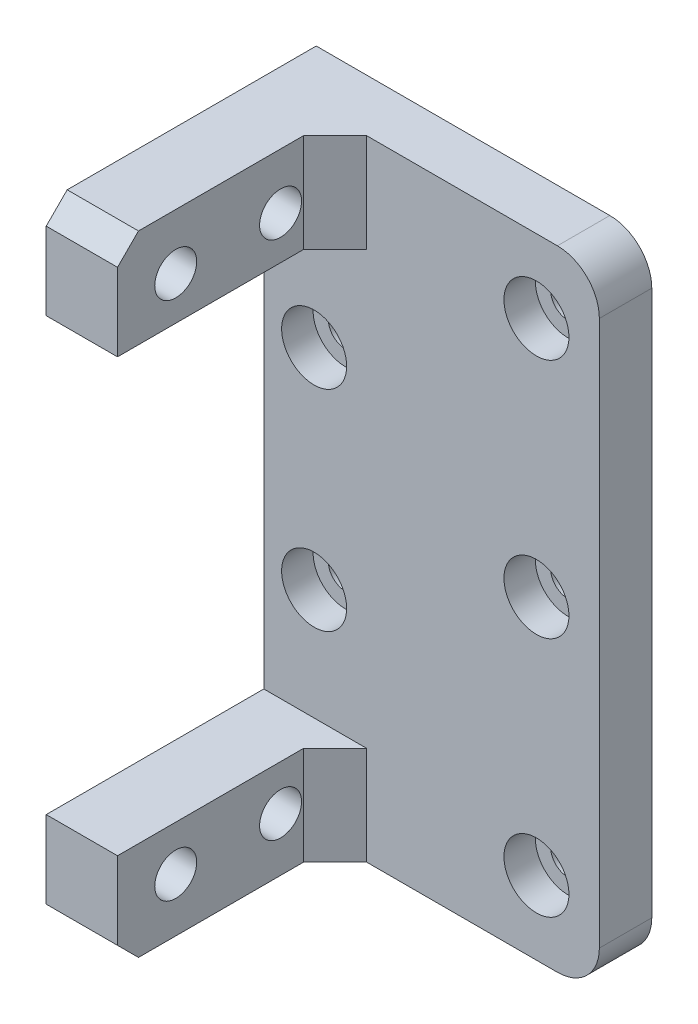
from build123d import *

# Parameters (mm, degrees)
SKETCH_1_W          = 32
SKETCH_1_H          = 60
EXTRUDE_1_DEPTH     = 5
SKETCH_2_W          = 6.8
SKETCH_2_H          = 9.4
EXTRUDE_2_DEPTH     = 19.55
SKETCH_3_R          = 2
CUT_EXTRUDE_1_DEPTH = 6.8
SKETCH_4_R          = 1.65
CUT_EXTRUDE_2_DEPTH = 5
FILLET_1_R          = 4
SKETCH_6_R          = 3.1
CUT_EXTRUDE_4_DEPTH = 3
SKETCH_7_W          = 6.8
SKETCH_7_H          = 9.4
EXTRUDE_3_DEPTH     = 1.2
SKETCH_8_W          = 5
SKETCH_8_H          = 60
EXTRUDE_4_DEPTH     = 6.8
CHAMFER_2_SIZE      = 3
SKETCH_9_W          = 13.52496211
SKETCH_9_H          = 60.92969016
CUT_EXTRUDE_5_DEPTH = 10
CHAMFER_3_SIZE      = 2
CHAMFER_4_SIZE      = 3


with BuildPart() as part:
    # Sketch 1 → Extrude 1 (new body)
    with BuildSketch(Plane.XY):
        with Locations((-1.5, -30)):
            Rectangle(SKETCH_1_W, SKETCH_1_H)
    extrude(amount=EXTRUDE_1_DEPTH)

    # Sketch 2 → Extrude 2 (add)
    with BuildSketch(Plane.XY.offset(5)):
        with Locations((-14.1, -4.7)):
            Rectangle(SKETCH_2_W, SKETCH_2_H)
        with Locations((-14.1, -55.3)):
            Rectangle(SKETCH_2_W, SKETCH_2_H)
    extrude(amount=EXTRUDE_2_DEPTH)

    # Sketch 3 → Cut-Extrude 1 (cut)
    with BuildSketch(Plane.ZY.offset(17.5)):
        with Locations((10.2, -54.9)):
            Circle(SKETCH_3_R)
        with Locations((20.2, -54.9)):
            Circle(SKETCH_3_R)
        with Locations((20.2, -5.3)):
            Circle(SKETCH_3_R)
        with Locations((10.2, -5.3)):
            Circle(SKETCH_3_R)
    extrude(amount=-CUT_EXTRUDE_1_DEPTH, mode=Mode.SUBTRACT)

    # Sketch 4 → Cut-Extrude 2 (cut)
    with BuildSketch(Plane.XY.offset(5)):
        with Locations((-12.7, -20)):
            Circle(SKETCH_4_R)
        with Locations((-12.7, -40)):
            Circle(SKETCH_4_R)
        with Locations((8.5, -7)):
            Circle(SKETCH_4_R)
        with Locations((8.5, -53)):
            Circle(SKETCH_4_R)
        with Locations((8.5, -30)):
            Circle(SKETCH_4_R)
    extrude(amount=-CUT_EXTRUDE_2_DEPTH, mode=Mode.SUBTRACT)

    # Fillet 1
    fillet_1_edges = [part.edges().sort_by_distance(p)[0] for p in [
        (14.5, 0, 2.5),
        (14.5, -60, 2.5),
    ]]
    fillet(fillet_1_edges, radius=FILLET_1_R)

    # Sketch 6 → Cut-Extrude 4 (cut)
    with BuildSketch(Plane.XY.offset(5)):
        with Locations((-12.7, -20)):
            Circle(SKETCH_6_R)
        with Locations((8.5, -7)):
            Circle(SKETCH_6_R)
        with Locations((8.5, -30)):
            Circle(SKETCH_6_R)
        with Locations((-12.7, -40)):
            Circle(SKETCH_6_R)
        with Locations((8.5, -53)):
            Circle(SKETCH_6_R)
    extrude(amount=-CUT_EXTRUDE_4_DEPTH, mode=Mode.SUBTRACT)

    # Sketch 7 → Extrude 3 (add)
    with BuildSketch(Plane.XY.offset(24.55)):
        with Locations((-14.1, -4.7)):
            Rectangle(SKETCH_7_W, SKETCH_7_H)
        with Locations((-14.1, -55.3)):
            Rectangle(SKETCH_7_W, SKETCH_7_H)
    extrude(amount=EXTRUDE_3_DEPTH)

    # Sketch 8 → Extrude 4 (add)
    with BuildSketch(Plane.ZY.offset(17.5)):
        with Locations((28.25, -30)):
            Rectangle(SKETCH_8_W, SKETCH_8_H)
    extrude(amount=-EXTRUDE_4_DEPTH)

    # Chamfer 2
    chamfer_2_edges = [part.edges().sort_by_distance(p)[0] for p in [
        (-14.1, 0, 30.75),
        (-14.1, -60, 30.75),
    ]]
    chamfer(chamfer_2_edges, length=CHAMFER_2_SIZE)

    # Sketch 9 → Cut-Extrude 5 (cut)
    with BuildSketch(Plane.ZY.offset(17.5)):
        with Locations((32.512481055, -29.53515492)):
            Rectangle(SKETCH_9_W, SKETCH_9_H)
    extrude(amount=-CUT_EXTRUDE_5_DEPTH, mode=Mode.SUBTRACT)

    # Chamfer 3
    chamfer_3_edges = [part.edges().sort_by_distance(p)[0] for p in [
        (-14.1, 0, 25.75),
        (-14.1, -60, 25.75),
    ]]
    chamfer(chamfer_3_edges, length=CHAMFER_3_SIZE)

    # Chamfer 4
    chamfer_4_edges = [part.edges().sort_by_distance(p)[0] for p in [
        (-10.7, -4.7, 5),
        (-10.7, -55.3, 5),
    ]]
    chamfer(chamfer_4_edges, length=CHAMFER_4_SIZE)


solid = part.part
